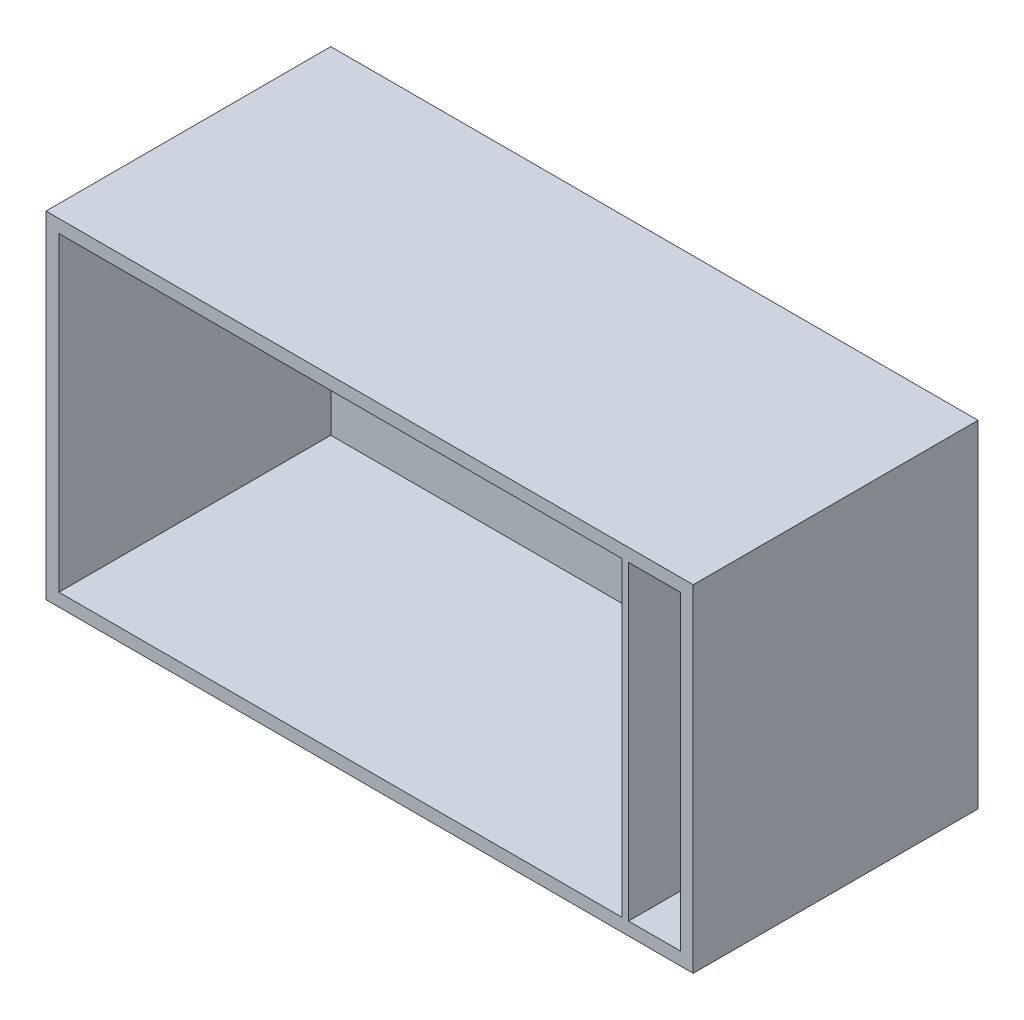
ISO-10303-21;
HEADER;
FILE_DESCRIPTION(('STEP AP214'),'2;1');
FILE_NAME('part.step','',(''),(''),'','','');
FILE_SCHEMA(('AUTOMOTIVE_DESIGN { 1 0 10303 214 1 1 1 1 }'));
ENDSEC;
DATA;
#1=APPLICATION_CONTEXT('core data for automotive mechanical design processes');
#2=APPLICATION_PROTOCOL_DEFINITION('international standard','automotive_design',2000,#1);
#3=PRODUCT_CONTEXT('',#1,'mechanical');
#4=PRODUCT('Part','Part','',(#3));
#5=PRODUCT_RELATED_PRODUCT_CATEGORY('part','',(#4));
#6=PRODUCT_DEFINITION_FORMATION('','',#4);
#7=PRODUCT_DEFINITION_CONTEXT('part definition',#1,'design');
#8=PRODUCT_DEFINITION('design','',#6,#7);
#9=PRODUCT_DEFINITION_SHAPE('','',#8);
#10=(LENGTH_UNIT() NAMED_UNIT(*) SI_UNIT(.MILLI.,.METRE.));
#11=(NAMED_UNIT(*) PLANE_ANGLE_UNIT() SI_UNIT($,.RADIAN.));
#12=(NAMED_UNIT(*) SI_UNIT($,.STERADIAN.) SOLID_ANGLE_UNIT());
#13=UNCERTAINTY_MEASURE_WITH_UNIT(LENGTH_MEASURE(1.E-05),#10,'distance_accuracy_value','');
#14=(GEOMETRIC_REPRESENTATION_CONTEXT(3) GLOBAL_UNCERTAINTY_ASSIGNED_CONTEXT((#13)) GLOBAL_UNIT_ASSIGNED_CONTEXT((#10,
#11,#12)) REPRESENTATION_CONTEXT('',''));
#15=CARTESIAN_POINT('',(0.,0.,0.));
#16=DIRECTION('',(0.,0.,1.));
#17=DIRECTION('',(1.,0.,0.));
#18=AXIS2_PLACEMENT_3D('',#15,#16,#17);
#19=CARTESIAN_POINT('',(0.,0.,266.7));
#20=DIRECTION('',(0.,1.,0.));
#21=DIRECTION('',(0.,0.,1.));
#22=AXIS2_PLACEMENT_3D('',#19,#20,#21);
#23=PLANE('',#22);
#24=DIRECTION('',(1.,0.,0.));
#25=VECTOR('',#24,1.);
#26=CARTESIAN_POINT('',(0.,0.,0.));
#27=LINE('',#26,#25);
#28=CARTESIAN_POINT('',(558.8,0.,0.));
#29=VERTEX_POINT('',#28);
#30=CARTESIAN_POINT('',(609.6,0.,0.));
#31=VERTEX_POINT('',#30);
#32=EDGE_CURVE('E130',#29,#31,#27,.T.);
#33=ORIENTED_EDGE('',*,*,#32,.F.);
#34=DIRECTION('',(0.,0.,-1.));
#35=VECTOR('',#34,1.);
#36=CARTESIAN_POINT('',(558.8,0.,571.566138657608));
#37=LINE('',#36,#35);
#38=CARTESIAN_POINT('',(558.8,0.,266.7));
#39=VERTEX_POINT('',#38);
#40=EDGE_CURVE('E46',#39,#29,#37,.T.);
#41=ORIENTED_EDGE('',*,*,#40,.F.);
#42=DIRECTION('',(1.,0.,0.));
#43=VECTOR('',#42,1.);
#44=CARTESIAN_POINT('',(0.,0.,266.7));
#45=LINE('',#44,#43);
#46=CARTESIAN_POINT('',(609.6,0.,266.7));
#47=VERTEX_POINT('',#46);
#48=EDGE_CURVE('E168',#39,#47,#45,.T.);
#49=ORIENTED_EDGE('',*,*,#48,.T.);
#50=DIRECTION('',(0.,0.,-1.));
#51=VECTOR('',#50,1.);
#52=CARTESIAN_POINT('',(609.6,0.,266.7));
#53=LINE('',#52,#51);
#54=EDGE_CURVE('E188',#47,#31,#53,.T.);
#55=ORIENTED_EDGE('',*,*,#54,.T.);
#56=EDGE_LOOP('',(#33,#41,#49,#55));
#57=FACE_BOUND('',#56,.T.);
#58=ADVANCED_FACE('F31',(#57),#23,.T.);
#59=CARTESIAN_POINT('',(0.,0.,266.7));
#60=VERTEX_POINT('',#59);
#61=CARTESIAN_POINT('',(552.45,0.,266.7));
#62=VERTEX_POINT('',#61);
#63=EDGE_CURVE('E54',#60,#62,#45,.T.);
#64=ORIENTED_EDGE('',*,*,#63,.T.);
#65=DIRECTION('',(0.,0.,-1.));
#66=VECTOR('',#65,1.);
#67=CARTESIAN_POINT('',(552.45,0.,571.566138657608));
#68=LINE('',#67,#66);
#69=CARTESIAN_POINT('',(552.45,0.,0.));
#70=VERTEX_POINT('',#69);
#71=EDGE_CURVE('E133',#62,#70,#68,.T.);
#72=ORIENTED_EDGE('',*,*,#71,.T.);
#73=CARTESIAN_POINT('',(0.,0.,0.));
#74=VERTEX_POINT('',#73);
#75=EDGE_CURVE('E121',#74,#70,#27,.T.);
#76=ORIENTED_EDGE('',*,*,#75,.F.);
#77=DIRECTION('',(0.,0.,-1.));
#78=VECTOR('',#77,1.);
#79=CARTESIAN_POINT('',(0.,0.,266.7));
#80=LINE('',#79,#78);
#81=EDGE_CURVE('E191',#60,#74,#80,.T.);
#82=ORIENTED_EDGE('',*,*,#81,.F.);
#83=EDGE_LOOP('',(#64,#72,#76,#82));
#84=FACE_BOUND('',#83,.T.);
#85=ADVANCED_FACE('F134',(#84),#23,.T.);
#86=CARTESIAN_POINT('',(0.,304.8,266.7));
#87=DIRECTION('',(0.,-1.,0.));
#88=DIRECTION('',(0.,0.,-1.));
#89=AXIS2_PLACEMENT_3D('',#86,#87,#88);
#90=PLANE('',#89);
#91=DIRECTION('',(-1.,0.,0.));
#92=VECTOR('',#91,1.);
#93=CARTESIAN_POINT('',(0.,304.8,266.7));
#94=LINE('',#93,#92);
#95=CARTESIAN_POINT('',(609.6,304.8,266.7));
#96=VERTEX_POINT('',#95);
#97=CARTESIAN_POINT('',(558.8,304.8,266.7));
#98=VERTEX_POINT('',#97);
#99=EDGE_CURVE('E175',#96,#98,#94,.T.);
#100=ORIENTED_EDGE('',*,*,#99,.T.);
#101=DIRECTION('',(0.,0.,-1.));
#102=VECTOR('',#101,1.);
#103=CARTESIAN_POINT('',(558.8,304.8,571.566138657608));
#104=LINE('',#103,#102);
#105=CARTESIAN_POINT('',(558.8,304.8,0.));
#106=VERTEX_POINT('',#105);
#107=EDGE_CURVE('E151',#98,#106,#104,.T.);
#108=ORIENTED_EDGE('',*,*,#107,.T.);
#109=DIRECTION('',(-1.,0.,0.));
#110=VECTOR('',#109,1.);
#111=CARTESIAN_POINT('',(0.,304.8,0.));
#112=LINE('',#111,#110);
#113=CARTESIAN_POINT('',(609.6,304.8,0.));
#114=VERTEX_POINT('',#113);
#115=EDGE_CURVE('E169',#114,#106,#112,.T.);
#116=ORIENTED_EDGE('',*,*,#115,.F.);
#117=DIRECTION('',(0.,0.,-1.));
#118=VECTOR('',#117,1.);
#119=CARTESIAN_POINT('',(609.6,304.8,266.7));
#120=LINE('',#119,#118);
#121=EDGE_CURVE('E186',#96,#114,#120,.T.);
#122=ORIENTED_EDGE('',*,*,#121,.F.);
#123=EDGE_LOOP('',(#100,#108,#116,#122));
#124=FACE_BOUND('',#123,.T.);
#125=ADVANCED_FACE('F240',(#124),#90,.T.);
#126=CARTESIAN_POINT('',(552.45,304.8,0.));
#127=VERTEX_POINT('',#126);
#128=CARTESIAN_POINT('',(0.,304.8,0.));
#129=VERTEX_POINT('',#128);
#130=EDGE_CURVE('E181',#127,#129,#112,.T.);
#131=ORIENTED_EDGE('',*,*,#130,.F.);
#132=DIRECTION('',(0.,0.,-1.));
#133=VECTOR('',#132,1.);
#134=CARTESIAN_POINT('',(552.45,304.8,571.566138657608));
#135=LINE('',#134,#133);
#136=CARTESIAN_POINT('',(552.45,304.8,266.7));
#137=VERTEX_POINT('',#136);
#138=EDGE_CURVE('E141',#137,#127,#135,.T.);
#139=ORIENTED_EDGE('',*,*,#138,.F.);
#140=CARTESIAN_POINT('',(0.,304.8,266.7));
#141=VERTEX_POINT('',#140);
#142=EDGE_CURVE('E174',#137,#141,#94,.T.);
#143=ORIENTED_EDGE('',*,*,#142,.T.);
#144=DIRECTION('',(0.,0.,-1.));
#145=VECTOR('',#144,1.);
#146=CARTESIAN_POINT('',(0.,304.8,266.7));
#147=LINE('',#146,#145);
#148=EDGE_CURVE('E177',#141,#129,#147,.T.);
#149=ORIENTED_EDGE('',*,*,#148,.T.);
#150=EDGE_LOOP('',(#131,#139,#143,#149));
#151=FACE_BOUND('',#150,.T.);
#152=ADVANCED_FACE('F321',(#151),#90,.T.);
#153=CARTESIAN_POINT('',(622.3,-12.7,0.));
#154=DIRECTION('',(0.,0.,-1.));
#155=DIRECTION('',(-1.,0.,0.));
#156=AXIS2_PLACEMENT_3D('',#153,#154,#155);
#157=PLANE('',#156);
#158=DIRECTION('',(0.,1.,0.));
#159=VECTOR('',#158,1.);
#160=CARTESIAN_POINT('',(558.8,304.8,0.));
#161=LINE('',#160,#159);
#162=EDGE_CURVE('E142',#29,#106,#161,.T.);
#163=ORIENTED_EDGE('',*,*,#162,.F.);
#164=ORIENTED_EDGE('',*,*,#32,.T.);
#165=DIRECTION('',(0.,1.,0.));
#166=VECTOR('',#165,1.);
#167=CARTESIAN_POINT('',(609.6,0.,0.));
#168=LINE('',#167,#166);
#169=EDGE_CURVE('E129',#31,#114,#168,.T.);
#170=ORIENTED_EDGE('',*,*,#169,.T.);
#171=ORIENTED_EDGE('',*,*,#115,.T.);
#172=EDGE_LOOP('',(#163,#164,#170,#171));
#173=FACE_BOUND('',#172,.T.);
#174=ADVANCED_FACE('F329',(#173),#157,.F.);
#175=DIRECTION('',(0.,-1.,0.));
#176=VECTOR('',#175,1.);
#177=CARTESIAN_POINT('',(552.45,304.8,0.));
#178=LINE('',#177,#176);
#179=EDGE_CURVE('E124',#127,#70,#178,.T.);
#180=ORIENTED_EDGE('',*,*,#179,.F.);
#181=ORIENTED_EDGE('',*,*,#130,.T.);
#182=DIRECTION('',(0.,-1.,0.));
#183=VECTOR('',#182,1.);
#184=CARTESIAN_POINT('',(0.,0.,0.));
#185=LINE('',#184,#183);
#186=EDGE_CURVE('E127',#129,#74,#185,.T.);
#187=ORIENTED_EDGE('',*,*,#186,.T.);
#188=ORIENTED_EDGE('',*,*,#75,.T.);
#189=EDGE_LOOP('',(#180,#181,#187,#188));
#190=FACE_BOUND('',#189,.T.);
#191=ADVANCED_FACE('F122',(#190),#157,.F.);
#192=CARTESIAN_POINT('',(-12.7,317.5,266.7));
#193=DIRECTION('',(0.,0.,-1.));
#194=DIRECTION('',(-1.,0.,0.));
#195=AXIS2_PLACEMENT_3D('',#192,#193,#194);
#196=PLANE('',#195);
#197=DIRECTION('',(0.,1.,0.));
#198=VECTOR('',#197,1.);
#199=CARTESIAN_POINT('',(552.45,304.8,266.7));
#200=LINE('',#199,#198);
#201=EDGE_CURVE('E147',#62,#137,#200,.T.);
#202=ORIENTED_EDGE('',*,*,#201,.F.);
#203=ORIENTED_EDGE('',*,*,#63,.F.);
#204=DIRECTION('',(0.,-1.,0.));
#205=VECTOR('',#204,1.);
#206=CARTESIAN_POINT('',(0.,0.,266.7));
#207=LINE('',#206,#205);
#208=EDGE_CURVE('E166',#141,#60,#207,.T.);
#209=ORIENTED_EDGE('',*,*,#208,.F.);
#210=ORIENTED_EDGE('',*,*,#142,.F.);
#211=EDGE_LOOP('',(#202,#203,#209,#210));
#212=FACE_BOUND('',#211,.T.);
#213=DIRECTION('',(0.,-1.,0.));
#214=VECTOR('',#213,1.);
#215=CARTESIAN_POINT('',(-12.7,-12.7,266.7));
#216=LINE('',#215,#214);
#217=CARTESIAN_POINT('',(-12.7,317.5,266.7));
#218=VERTEX_POINT('',#217);
#219=CARTESIAN_POINT('',(-12.7,-12.7,266.7));
#220=VERTEX_POINT('',#219);
#221=EDGE_CURVE('E193',#218,#220,#216,.T.);
#222=ORIENTED_EDGE('',*,*,#221,.T.);
#223=DIRECTION('',(1.,0.,0.));
#224=VECTOR('',#223,1.);
#225=CARTESIAN_POINT('',(-12.7,-12.7,266.7));
#226=LINE('',#225,#224);
#227=CARTESIAN_POINT('',(622.3,-12.7,266.7));
#228=VERTEX_POINT('',#227);
#229=EDGE_CURVE('E196',#220,#228,#226,.T.);
#230=ORIENTED_EDGE('',*,*,#229,.T.);
#231=DIRECTION('',(0.,1.,0.));
#232=VECTOR('',#231,1.);
#233=CARTESIAN_POINT('',(622.3,-12.7,266.7));
#234=LINE('',#233,#232);
#235=CARTESIAN_POINT('',(622.3,317.5,266.7));
#236=VERTEX_POINT('',#235);
#237=EDGE_CURVE('E198',#228,#236,#234,.T.);
#238=ORIENTED_EDGE('',*,*,#237,.T.);
#239=DIRECTION('',(-1.,0.,0.));
#240=VECTOR('',#239,1.);
#241=CARTESIAN_POINT('',(-12.7,317.5,266.7));
#242=LINE('',#241,#240);
#243=EDGE_CURVE('E200',#236,#218,#242,.T.);
#244=ORIENTED_EDGE('',*,*,#243,.T.);
#245=EDGE_LOOP('',(#222,#230,#238,#244));
#246=FACE_BOUND('',#245,.T.);
#247=ORIENTED_EDGE('',*,*,#48,.F.);
#248=DIRECTION('',(0.,-1.,0.));
#249=VECTOR('',#248,1.);
#250=CARTESIAN_POINT('',(558.8,304.8,266.7));
#251=LINE('',#250,#249);
#252=EDGE_CURVE('E137',#98,#39,#251,.T.);
#253=ORIENTED_EDGE('',*,*,#252,.F.);
#254=ORIENTED_EDGE('',*,*,#99,.F.);
#255=DIRECTION('',(0.,1.,0.));
#256=VECTOR('',#255,1.);
#257=CARTESIAN_POINT('',(609.6,0.,266.7));
#258=LINE('',#257,#256);
#259=EDGE_CURVE('E171',#47,#96,#258,.T.);
#260=ORIENTED_EDGE('',*,*,#259,.F.);
#261=EDGE_LOOP('',(#247,#253,#254,#260));
#262=FACE_BOUND('',#261,.T.);
#263=ADVANCED_FACE('F225',(#212,#246,#262),#196,.F.);
#264=CARTESIAN_POINT('',(-12.7,-12.7,266.7));
#265=DIRECTION('',(1.,0.,0.));
#266=DIRECTION('',(0.,0.,-1.));
#267=AXIS2_PLACEMENT_3D('',#264,#265,#266);
#268=PLANE('',#267);
#269=DIRECTION('',(0.,0.,-1.));
#270=VECTOR('',#269,1.);
#271=CARTESIAN_POINT('',(-12.7,317.5,266.7));
#272=LINE('',#271,#270);
#273=CARTESIAN_POINT('',(-12.7,317.5,-12.7));
#274=VERTEX_POINT('',#273);
#275=EDGE_CURVE('E202',#218,#274,#272,.T.);
#276=ORIENTED_EDGE('',*,*,#275,.T.);
#277=DIRECTION('',(0.,1.,0.));
#278=VECTOR('',#277,1.);
#279=CARTESIAN_POINT('',(-12.7,317.5,-12.7));
#280=LINE('',#279,#278);
#281=CARTESIAN_POINT('',(-12.7,-12.7,-12.7));
#282=VERTEX_POINT('',#281);
#283=EDGE_CURVE('E160',#282,#274,#280,.T.);
#284=ORIENTED_EDGE('',*,*,#283,.F.);
#285=DIRECTION('',(0.,0.,-1.));
#286=VECTOR('',#285,1.);
#287=CARTESIAN_POINT('',(-12.7,-12.7,266.7));
#288=LINE('',#287,#286);
#289=EDGE_CURVE('E11',#220,#282,#288,.T.);
#290=ORIENTED_EDGE('',*,*,#289,.F.);
#291=ORIENTED_EDGE('',*,*,#221,.F.);
#292=EDGE_LOOP('',(#276,#284,#290,#291));
#293=FACE_BOUND('',#292,.T.);
#294=ADVANCED_FACE('F33',(#293),#268,.F.);
#295=CARTESIAN_POINT('',(-12.7,-12.7,266.7));
#296=DIRECTION('',(0.,1.,0.));
#297=DIRECTION('',(-1.,0.,0.));
#298=AXIS2_PLACEMENT_3D('',#295,#296,#297);
#299=PLANE('',#298);
#300=ORIENTED_EDGE('',*,*,#289,.T.);
#301=DIRECTION('',(-1.,0.,0.));
#302=VECTOR('',#301,1.);
#303=CARTESIAN_POINT('',(622.3,-12.7,-12.7));
#304=LINE('',#303,#302);
#305=CARTESIAN_POINT('',(622.3,-12.7,-12.7));
#306=VERTEX_POINT('',#305);
#307=EDGE_CURVE('E157',#306,#282,#304,.T.);
#308=ORIENTED_EDGE('',*,*,#307,.F.);
#309=DIRECTION('',(0.,0.,-1.));
#310=VECTOR('',#309,1.);
#311=CARTESIAN_POINT('',(622.3,-12.7,266.7));
#312=LINE('',#311,#310);
#313=EDGE_CURVE('E39',#228,#306,#312,.T.);
#314=ORIENTED_EDGE('',*,*,#313,.F.);
#315=ORIENTED_EDGE('',*,*,#229,.F.);
#316=EDGE_LOOP('',(#300,#308,#314,#315));
#317=FACE_BOUND('',#316,.T.);
#318=ADVANCED_FACE('F213',(#317),#299,.F.);
#319=CARTESIAN_POINT('',(622.3,-12.7,266.7));
#320=DIRECTION('',(-1.,0.,0.));
#321=DIRECTION('',(0.,0.,1.));
#322=AXIS2_PLACEMENT_3D('',#319,#320,#321);
#323=PLANE('',#322);
#324=ORIENTED_EDGE('',*,*,#313,.T.);
#325=DIRECTION('',(0.,-1.,0.));
#326=VECTOR('',#325,1.);
#327=CARTESIAN_POINT('',(622.3,317.5,-12.7));
#328=LINE('',#327,#326);
#329=CARTESIAN_POINT('',(622.3,317.5,-12.7));
#330=VERTEX_POINT('',#329);
#331=EDGE_CURVE('E154',#330,#306,#328,.T.);
#332=ORIENTED_EDGE('',*,*,#331,.F.);
#333=DIRECTION('',(0.,0.,-1.));
#334=VECTOR('',#333,1.);
#335=CARTESIAN_POINT('',(622.3,317.5,266.7));
#336=LINE('',#335,#334);
#337=EDGE_CURVE('E204',#236,#330,#336,.T.);
#338=ORIENTED_EDGE('',*,*,#337,.F.);
#339=ORIENTED_EDGE('',*,*,#237,.F.);
#340=EDGE_LOOP('',(#324,#332,#338,#339));
#341=FACE_BOUND('',#340,.T.);
#342=ADVANCED_FACE('F210',(#341),#323,.F.);
#343=CARTESIAN_POINT('',(-12.7,317.5,266.7));
#344=DIRECTION('',(0.,-1.,0.));
#345=DIRECTION('',(0.,0.,-1.));
#346=AXIS2_PLACEMENT_3D('',#343,#344,#345);
#347=PLANE('',#346);
#348=ORIENTED_EDGE('',*,*,#337,.T.);
#349=DIRECTION('',(1.,0.,0.));
#350=VECTOR('',#349,1.);
#351=CARTESIAN_POINT('',(622.3,317.5,-12.7));
#352=LINE('',#351,#350);
#353=EDGE_CURVE('E163',#274,#330,#352,.T.);
#354=ORIENTED_EDGE('',*,*,#353,.F.);
#355=ORIENTED_EDGE('',*,*,#275,.F.);
#356=ORIENTED_EDGE('',*,*,#243,.F.);
#357=EDGE_LOOP('',(#348,#354,#355,#356));
#358=FACE_BOUND('',#357,.T.);
#359=ADVANCED_FACE('F221',(#358),#347,.F.);
#360=CARTESIAN_POINT('',(0.,0.,266.7));
#361=DIRECTION('',(1.,0.,0.));
#362=DIRECTION('',(0.,0.,-1.));
#363=AXIS2_PLACEMENT_3D('',#360,#361,#362);
#364=PLANE('',#363);
#365=ORIENTED_EDGE('',*,*,#186,.F.);
#366=ORIENTED_EDGE('',*,*,#148,.F.);
#367=ORIENTED_EDGE('',*,*,#208,.T.);
#368=ORIENTED_EDGE('',*,*,#81,.T.);
#369=EDGE_LOOP('',(#365,#366,#367,#368));
#370=FACE_BOUND('',#369,.T.);
#371=ADVANCED_FACE('F245',(#370),#364,.T.);
#372=CARTESIAN_POINT('',(609.6,0.,266.7));
#373=DIRECTION('',(-1.,0.,0.));
#374=DIRECTION('',(0.,0.,1.));
#375=AXIS2_PLACEMENT_3D('',#372,#373,#374);
#376=PLANE('',#375);
#377=ORIENTED_EDGE('',*,*,#169,.F.);
#378=ORIENTED_EDGE('',*,*,#54,.F.);
#379=ORIENTED_EDGE('',*,*,#259,.T.);
#380=ORIENTED_EDGE('',*,*,#121,.T.);
#381=EDGE_LOOP('',(#377,#378,#379,#380));
#382=FACE_BOUND('',#381,.T.);
#383=ADVANCED_FACE('F243',(#382),#376,.T.);
#384=CARTESIAN_POINT('',(622.3,-12.7,-12.7));
#385=DIRECTION('',(0.,0.,-1.));
#386=DIRECTION('',(-1.,0.,0.));
#387=AXIS2_PLACEMENT_3D('',#384,#385,#386);
#388=PLANE('',#387);
#389=ORIENTED_EDGE('',*,*,#331,.T.);
#390=ORIENTED_EDGE('',*,*,#307,.T.);
#391=ORIENTED_EDGE('',*,*,#283,.T.);
#392=ORIENTED_EDGE('',*,*,#353,.T.);
#393=EDGE_LOOP('',(#389,#390,#391,#392));
#394=FACE_BOUND('',#393,.T.);
#395=ADVANCED_FACE('F217',(#394),#388,.T.);
#396=CARTESIAN_POINT('',(558.8,304.8,571.566138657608));
#397=DIRECTION('',(-1.,0.,0.));
#398=DIRECTION('',(0.,0.,1.));
#399=AXIS2_PLACEMENT_3D('',#396,#397,#398);
#400=PLANE('',#399);
#401=ORIENTED_EDGE('',*,*,#107,.F.);
#402=ORIENTED_EDGE('',*,*,#252,.T.);
#403=ORIENTED_EDGE('',*,*,#40,.T.);
#404=ORIENTED_EDGE('',*,*,#162,.T.);
#405=EDGE_LOOP('',(#401,#402,#403,#404));
#406=FACE_BOUND('',#405,.T.);
#407=ADVANCED_FACE('F276',(#406),#400,.F.);
#408=CARTESIAN_POINT('',(552.45,304.8,571.566138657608));
#409=DIRECTION('',(1.,0.,0.));
#410=DIRECTION('',(0.,0.,-1.));
#411=AXIS2_PLACEMENT_3D('',#408,#409,#410);
#412=PLANE('',#411);
#413=ORIENTED_EDGE('',*,*,#71,.F.);
#414=ORIENTED_EDGE('',*,*,#201,.T.);
#415=ORIENTED_EDGE('',*,*,#138,.T.);
#416=ORIENTED_EDGE('',*,*,#179,.T.);
#417=EDGE_LOOP('',(#413,#414,#415,#416));
#418=FACE_BOUND('',#417,.T.);
#419=ADVANCED_FACE('F140',(#418),#412,.F.);
#420=CLOSED_SHELL('',(#58,#85,#125,#152,#174,#191,#263,#294,#318,#342,#359,#371,#383,#395,#407,#419));
#421=MANIFOLD_SOLID_BREP('B2',#420);
#422=ADVANCED_BREP_SHAPE_REPRESENTATION('',(#18,#421),#14);
#423=SHAPE_DEFINITION_REPRESENTATION(#9,#422);
ENDSEC;
END-ISO-10303-21;
